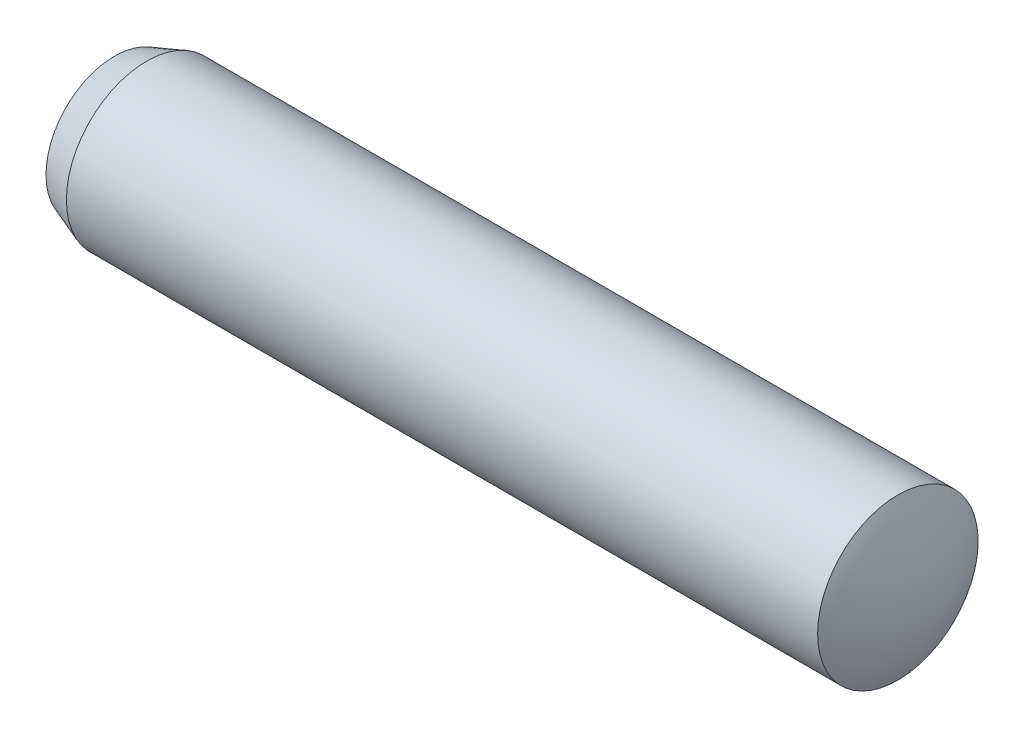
from build123d import *


with BuildPart() as part:
    # Esquisse1 → Base-R_volution (revolve)
    with BuildSketch(Plane.XY, mode=Mode.PRIVATE) as base_r_volution_sk:
        with BuildLine():
            Line((0, 0), (0, 4.272059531))
            Line((0, 4.272059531), (2, 5))
            Line((2, 5), (48.8, 5))
            ThreePointArc((48.8, 5), (49.69580011, 2.570992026), (50, 0))
            Line((50, 0), (0, 0))
        make_face()
    revolve(base_r_volution_sk.sketch.rotate(Axis((0, 0, 0), (1, 0, 0)), 90), axis=Axis((0, 0, 0), (1, 0, 0)))


solid = part.part
